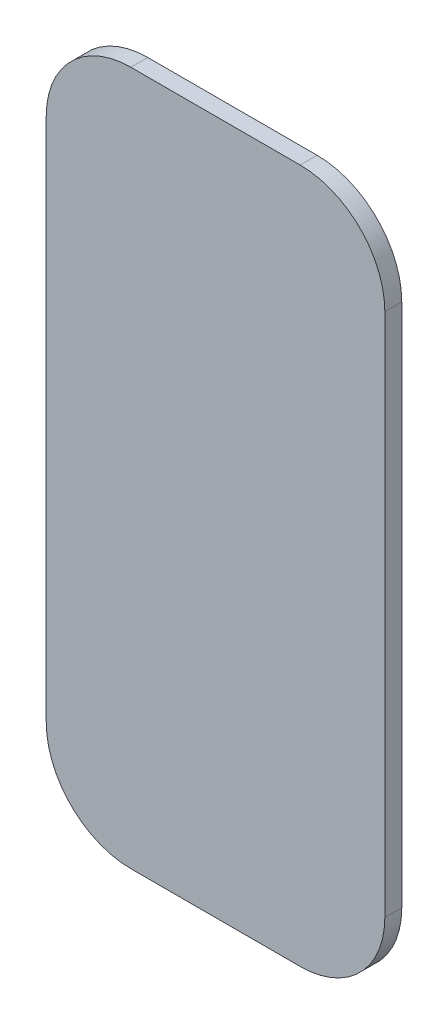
ISO-10303-21;
HEADER;
FILE_DESCRIPTION(('STEP AP214'),'2;1');
FILE_NAME('part.step','',(''),(''),'','','');
FILE_SCHEMA(('AUTOMOTIVE_DESIGN { 1 0 10303 214 1 1 1 1 }'));
ENDSEC;
DATA;
#1=APPLICATION_CONTEXT('core data for automotive mechanical design processes');
#2=APPLICATION_PROTOCOL_DEFINITION('international standard','automotive_design',2000,#1);
#3=PRODUCT_CONTEXT('',#1,'mechanical');
#4=PRODUCT('Part','Part','',(#3));
#5=PRODUCT_RELATED_PRODUCT_CATEGORY('part','',(#4));
#6=PRODUCT_DEFINITION_FORMATION('','',#4);
#7=PRODUCT_DEFINITION_CONTEXT('part definition',#1,'design');
#8=PRODUCT_DEFINITION('design','',#6,#7);
#9=PRODUCT_DEFINITION_SHAPE('','',#8);
#10=(LENGTH_UNIT() NAMED_UNIT(*) SI_UNIT(.MILLI.,.METRE.));
#11=(NAMED_UNIT(*) PLANE_ANGLE_UNIT() SI_UNIT($,.RADIAN.));
#12=(NAMED_UNIT(*) SI_UNIT($,.STERADIAN.) SOLID_ANGLE_UNIT());
#13=UNCERTAINTY_MEASURE_WITH_UNIT(LENGTH_MEASURE(1.E-05),#10,'distance_accuracy_value','');
#14=(GEOMETRIC_REPRESENTATION_CONTEXT(3) GLOBAL_UNCERTAINTY_ASSIGNED_CONTEXT((#13)) GLOBAL_UNIT_ASSIGNED_CONTEXT((#10,
#11,#12)) REPRESENTATION_CONTEXT('',''));
#15=CARTESIAN_POINT('',(0.,0.,0.));
#16=DIRECTION('',(0.,0.,1.));
#17=DIRECTION('',(1.,0.,0.));
#18=AXIS2_PLACEMENT_3D('',#15,#16,#17);
#19=CARTESIAN_POINT('',(250.,-775.,-50.));
#20=DIRECTION('',(0.,0.,1.));
#21=DIRECTION('',(1.,0.,0.));
#22=AXIS2_PLACEMENT_3D('',#19,#20,#21);
#23=CYLINDRICAL_SURFACE('',#22,250.);
#24=CARTESIAN_POINT('',(250.,-775.,0.));
#25=DIRECTION('',(0.,0.,1.));
#26=DIRECTION('',(1.,0.,0.));
#27=AXIS2_PLACEMENT_3D('',#24,#25,#26);
#28=CIRCLE('',#27,250.);
#29=CARTESIAN_POINT('',(249.999999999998,-1025.,0.));
#30=VERTEX_POINT('',#29);
#31=CARTESIAN_POINT('',(500.,-774.999999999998,0.));
#32=VERTEX_POINT('',#31);
#33=EDGE_CURVE('E134',#30,#32,#28,.T.);
#34=ORIENTED_EDGE('',*,*,#33,.F.);
#35=DIRECTION('',(0.,0.,1.));
#36=VECTOR('',#35,1.);
#37=CARTESIAN_POINT('',(249.999999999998,-1025.,-50.));
#38=LINE('',#37,#36);
#39=CARTESIAN_POINT('',(249.999999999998,-1025.,-50.));
#40=VERTEX_POINT('',#39);
#41=EDGE_CURVE('E11',#40,#30,#38,.T.);
#42=ORIENTED_EDGE('',*,*,#41,.F.);
#43=CARTESIAN_POINT('',(250.,-775.,-50.));
#44=DIRECTION('',(0.,0.,1.));
#45=DIRECTION('',(1.,0.,0.));
#46=AXIS2_PLACEMENT_3D('',#43,#44,#45);
#47=CIRCLE('',#46,250.);
#48=CARTESIAN_POINT('',(500.,-774.999999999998,-50.));
#49=VERTEX_POINT('',#48);
#50=EDGE_CURVE('E154',#40,#49,#47,.T.);
#51=ORIENTED_EDGE('',*,*,#50,.T.);
#52=DIRECTION('',(0.,0.,1.));
#53=VECTOR('',#52,1.);
#54=CARTESIAN_POINT('',(500.,-774.999999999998,-50.));
#55=LINE('',#54,#53);
#56=EDGE_CURVE('E40',#49,#32,#55,.T.);
#57=ORIENTED_EDGE('',*,*,#56,.T.);
#58=EDGE_LOOP('',(#34,#42,#51,#57));
#59=FACE_BOUND('',#58,.T.);
#60=ADVANCED_FACE('F37',(#59),#23,.T.);
#61=CARTESIAN_POINT('',(-249.999999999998,-1025.,-50.));
#62=DIRECTION('',(0.,-1.,0.));
#63=DIRECTION('',(0.,0.,-1.));
#64=AXIS2_PLACEMENT_3D('',#61,#62,#63);
#65=PLANE('',#64);
#66=DIRECTION('',(1.,0.,0.));
#67=VECTOR('',#66,1.);
#68=CARTESIAN_POINT('',(-249.999999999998,-1025.,0.));
#69=LINE('',#68,#67);
#70=CARTESIAN_POINT('',(-249.999999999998,-1025.,0.));
#71=VERTEX_POINT('',#70);
#72=EDGE_CURVE('E152',#71,#30,#69,.T.);
#73=ORIENTED_EDGE('',*,*,#72,.F.);
#74=DIRECTION('',(0.,0.,1.));
#75=VECTOR('',#74,1.);
#76=CARTESIAN_POINT('',(-249.999999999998,-1025.,-50.));
#77=LINE('',#76,#75);
#78=CARTESIAN_POINT('',(-249.999999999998,-1025.,-50.));
#79=VERTEX_POINT('',#78);
#80=EDGE_CURVE('E46',#79,#71,#77,.T.);
#81=ORIENTED_EDGE('',*,*,#80,.F.);
#82=DIRECTION('',(1.,0.,0.));
#83=VECTOR('',#82,1.);
#84=CARTESIAN_POINT('',(-249.999999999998,-1025.,-50.));
#85=LINE('',#84,#83);
#86=EDGE_CURVE('E124',#79,#40,#85,.T.);
#87=ORIENTED_EDGE('',*,*,#86,.T.);
#88=ORIENTED_EDGE('',*,*,#41,.T.);
#89=EDGE_LOOP('',(#73,#81,#87,#88));
#90=FACE_BOUND('',#89,.T.);
#91=ADVANCED_FACE('F166',(#90),#65,.T.);
#92=CARTESIAN_POINT('',(-250.,-775.,-50.));
#93=DIRECTION('',(0.,0.,1.));
#94=DIRECTION('',(1.,0.,0.));
#95=AXIS2_PLACEMENT_3D('',#92,#93,#94);
#96=CYLINDRICAL_SURFACE('',#95,250.);
#97=CARTESIAN_POINT('',(-250.,-775.,0.));
#98=DIRECTION('',(0.,0.,1.));
#99=DIRECTION('',(1.,0.,0.));
#100=AXIS2_PLACEMENT_3D('',#97,#98,#99);
#101=CIRCLE('',#100,250.);
#102=CARTESIAN_POINT('',(-500.,-774.999999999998,0.));
#103=VERTEX_POINT('',#102);
#104=EDGE_CURVE('E111',#103,#71,#101,.T.);
#105=ORIENTED_EDGE('',*,*,#104,.F.);
#106=DIRECTION('',(0.,0.,1.));
#107=VECTOR('',#106,1.);
#108=CARTESIAN_POINT('',(-500.,-774.999999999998,-50.));
#109=LINE('',#108,#107);
#110=CARTESIAN_POINT('',(-500.,-774.999999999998,-50.));
#111=VERTEX_POINT('',#110);
#112=EDGE_CURVE('E106',#111,#103,#109,.T.);
#113=ORIENTED_EDGE('',*,*,#112,.F.);
#114=CARTESIAN_POINT('',(-250.,-775.,-50.));
#115=DIRECTION('',(0.,0.,1.));
#116=DIRECTION('',(1.,0.,0.));
#117=AXIS2_PLACEMENT_3D('',#114,#115,#116);
#118=CIRCLE('',#117,250.);
#119=EDGE_CURVE('E109',#111,#79,#118,.T.);
#120=ORIENTED_EDGE('',*,*,#119,.T.);
#121=ORIENTED_EDGE('',*,*,#80,.T.);
#122=EDGE_LOOP('',(#105,#113,#120,#121));
#123=FACE_BOUND('',#122,.T.);
#124=ADVANCED_FACE('F108',(#123),#96,.T.);
#125=CARTESIAN_POINT('',(-500.,774.999999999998,-50.));
#126=DIRECTION('',(-1.,0.,0.));
#127=DIRECTION('',(0.,-1.,0.));
#128=AXIS2_PLACEMENT_3D('',#125,#126,#127);
#129=PLANE('',#128);
#130=DIRECTION('',(0.,-1.,0.));
#131=VECTOR('',#130,1.);
#132=CARTESIAN_POINT('',(-500.,774.999999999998,0.));
#133=LINE('',#132,#131);
#134=CARTESIAN_POINT('',(-500.,774.999999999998,0.));
#135=VERTEX_POINT('',#134);
#136=EDGE_CURVE('E149',#135,#103,#133,.T.);
#137=ORIENTED_EDGE('',*,*,#136,.F.);
#138=DIRECTION('',(0.,0.,1.));
#139=VECTOR('',#138,1.);
#140=CARTESIAN_POINT('',(-500.,774.999999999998,-50.));
#141=LINE('',#140,#139);
#142=CARTESIAN_POINT('',(-500.,774.999999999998,-50.));
#143=VERTEX_POINT('',#142);
#144=EDGE_CURVE('E116',#143,#135,#141,.T.);
#145=ORIENTED_EDGE('',*,*,#144,.F.);
#146=DIRECTION('',(0.,-1.,0.));
#147=VECTOR('',#146,1.);
#148=CARTESIAN_POINT('',(-500.,774.999999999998,-50.));
#149=LINE('',#148,#147);
#150=EDGE_CURVE('E122',#143,#111,#149,.T.);
#151=ORIENTED_EDGE('',*,*,#150,.T.);
#152=ORIENTED_EDGE('',*,*,#112,.T.);
#153=EDGE_LOOP('',(#137,#145,#151,#152));
#154=FACE_BOUND('',#153,.T.);
#155=ADVANCED_FACE('F126',(#154),#129,.T.);
#156=CARTESIAN_POINT('',(-250.,775.,-50.));
#157=DIRECTION('',(0.,0.,1.));
#158=DIRECTION('',(1.,0.,0.));
#159=AXIS2_PLACEMENT_3D('',#156,#157,#158);
#160=CYLINDRICAL_SURFACE('',#159,250.);
#161=CARTESIAN_POINT('',(-250.,775.,0.));
#162=DIRECTION('',(0.,0.,1.));
#163=DIRECTION('',(1.,0.,0.));
#164=AXIS2_PLACEMENT_3D('',#161,#162,#163);
#165=CIRCLE('',#164,250.);
#166=CARTESIAN_POINT('',(-249.999999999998,1025.,0.));
#167=VERTEX_POINT('',#166);
#168=EDGE_CURVE('E146',#167,#135,#165,.T.);
#169=ORIENTED_EDGE('',*,*,#168,.F.);
#170=DIRECTION('',(0.,0.,1.));
#171=VECTOR('',#170,1.);
#172=CARTESIAN_POINT('',(-249.999999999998,1025.,-50.));
#173=LINE('',#172,#171);
#174=CARTESIAN_POINT('',(-249.999999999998,1025.,-50.));
#175=VERTEX_POINT('',#174);
#176=EDGE_CURVE('E158',#175,#167,#173,.T.);
#177=ORIENTED_EDGE('',*,*,#176,.F.);
#178=CARTESIAN_POINT('',(-250.,775.,-50.));
#179=DIRECTION('',(0.,0.,1.));
#180=DIRECTION('',(1.,0.,0.));
#181=AXIS2_PLACEMENT_3D('',#178,#179,#180);
#182=CIRCLE('',#181,250.);
#183=EDGE_CURVE('E127',#175,#143,#182,.T.);
#184=ORIENTED_EDGE('',*,*,#183,.T.);
#185=ORIENTED_EDGE('',*,*,#144,.T.);
#186=EDGE_LOOP('',(#169,#177,#184,#185));
#187=FACE_BOUND('',#186,.T.);
#188=ADVANCED_FACE('F179',(#187),#160,.T.);
#189=CARTESIAN_POINT('',(-249.999999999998,1025.,-50.));
#190=DIRECTION('',(0.,1.,0.));
#191=DIRECTION('',(0.,0.,1.));
#192=AXIS2_PLACEMENT_3D('',#189,#190,#191);
#193=PLANE('',#192);
#194=DIRECTION('',(-1.,0.,0.));
#195=VECTOR('',#194,1.);
#196=CARTESIAN_POINT('',(-249.999999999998,1025.,0.));
#197=LINE('',#196,#195);
#198=CARTESIAN_POINT('',(249.999999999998,1025.,0.));
#199=VERTEX_POINT('',#198);
#200=EDGE_CURVE('E143',#199,#167,#197,.T.);
#201=ORIENTED_EDGE('',*,*,#200,.F.);
#202=DIRECTION('',(0.,0.,1.));
#203=VECTOR('',#202,1.);
#204=CARTESIAN_POINT('',(249.999999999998,1025.,-50.));
#205=LINE('',#204,#203);
#206=CARTESIAN_POINT('',(249.999999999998,1025.,-50.));
#207=VERTEX_POINT('',#206);
#208=EDGE_CURVE('E160',#207,#199,#205,.T.);
#209=ORIENTED_EDGE('',*,*,#208,.F.);
#210=DIRECTION('',(-1.,0.,0.));
#211=VECTOR('',#210,1.);
#212=CARTESIAN_POINT('',(-249.999999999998,1025.,-50.));
#213=LINE('',#212,#211);
#214=EDGE_CURVE('E129',#207,#175,#213,.T.);
#215=ORIENTED_EDGE('',*,*,#214,.T.);
#216=ORIENTED_EDGE('',*,*,#176,.T.);
#217=EDGE_LOOP('',(#201,#209,#215,#216));
#218=FACE_BOUND('',#217,.T.);
#219=ADVANCED_FACE('F182',(#218),#193,.T.);
#220=CARTESIAN_POINT('',(250.,775.,-50.));
#221=DIRECTION('',(0.,0.,1.));
#222=DIRECTION('',(1.,0.,0.));
#223=AXIS2_PLACEMENT_3D('',#220,#221,#222);
#224=CYLINDRICAL_SURFACE('',#223,250.);
#225=CARTESIAN_POINT('',(250.,775.,0.));
#226=DIRECTION('',(0.,0.,1.));
#227=DIRECTION('',(-1.,0.,0.));
#228=AXIS2_PLACEMENT_3D('',#225,#226,#227);
#229=CIRCLE('',#228,250.);
#230=CARTESIAN_POINT('',(500.,774.999999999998,0.));
#231=VERTEX_POINT('',#230);
#232=EDGE_CURVE('E140',#231,#199,#229,.T.);
#233=ORIENTED_EDGE('',*,*,#232,.F.);
#234=DIRECTION('',(0.,0.,1.));
#235=VECTOR('',#234,1.);
#236=CARTESIAN_POINT('',(500.,774.999999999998,-50.));
#237=LINE('',#236,#235);
#238=CARTESIAN_POINT('',(500.,774.999999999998,-50.));
#239=VERTEX_POINT('',#238);
#240=EDGE_CURVE('E161',#239,#231,#237,.T.);
#241=ORIENTED_EDGE('',*,*,#240,.F.);
#242=CARTESIAN_POINT('',(250.,775.,-50.));
#243=DIRECTION('',(0.,0.,1.));
#244=DIRECTION('',(-1.,0.,0.));
#245=AXIS2_PLACEMENT_3D('',#242,#243,#244);
#246=CIRCLE('',#245,250.);
#247=EDGE_CURVE('E257',#239,#207,#246,.T.);
#248=ORIENTED_EDGE('',*,*,#247,.T.);
#249=ORIENTED_EDGE('',*,*,#208,.T.);
#250=EDGE_LOOP('',(#233,#241,#248,#249));
#251=FACE_BOUND('',#250,.T.);
#252=ADVANCED_FACE('F186',(#251),#224,.T.);
#253=CARTESIAN_POINT('',(500.,774.999999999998,-50.));
#254=DIRECTION('',(1.,0.,0.));
#255=DIRECTION('',(0.,1.,0.));
#256=AXIS2_PLACEMENT_3D('',#253,#254,#255);
#257=PLANE('',#256);
#258=DIRECTION('',(0.,1.,0.));
#259=VECTOR('',#258,1.);
#260=CARTESIAN_POINT('',(500.,774.999999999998,0.));
#261=LINE('',#260,#259);
#262=EDGE_CURVE('E137',#32,#231,#261,.T.);
#263=ORIENTED_EDGE('',*,*,#262,.F.);
#264=ORIENTED_EDGE('',*,*,#56,.F.);
#265=DIRECTION('',(0.,1.,0.));
#266=VECTOR('',#265,1.);
#267=CARTESIAN_POINT('',(500.,774.999999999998,-50.));
#268=LINE('',#267,#266);
#269=EDGE_CURVE('E258',#49,#239,#268,.T.);
#270=ORIENTED_EDGE('',*,*,#269,.T.);
#271=ORIENTED_EDGE('',*,*,#240,.T.);
#272=EDGE_LOOP('',(#263,#264,#270,#271));
#273=FACE_BOUND('',#272,.T.);
#274=ADVANCED_FACE('F163',(#273),#257,.T.);
#275=CARTESIAN_POINT('',(250.,-775.,-50.));
#276=DIRECTION('',(0.,0.,1.));
#277=DIRECTION('',(1.,0.,0.));
#278=AXIS2_PLACEMENT_3D('',#275,#276,#277);
#279=PLANE('',#278);
#280=ORIENTED_EDGE('',*,*,#50,.F.);
#281=ORIENTED_EDGE('',*,*,#86,.F.);
#282=ORIENTED_EDGE('',*,*,#119,.F.);
#283=ORIENTED_EDGE('',*,*,#150,.F.);
#284=ORIENTED_EDGE('',*,*,#183,.F.);
#285=ORIENTED_EDGE('',*,*,#214,.F.);
#286=ORIENTED_EDGE('',*,*,#247,.F.);
#287=ORIENTED_EDGE('',*,*,#269,.F.);
#288=EDGE_LOOP('',(#280,#281,#282,#283,#284,#285,#286,#287));
#289=FACE_BOUND('',#288,.T.);
#290=ADVANCED_FACE('F120',(#289),#279,.F.);
#291=CARTESIAN_POINT('',(250.,-775.,0.));
#292=DIRECTION('',(0.,0.,1.));
#293=DIRECTION('',(1.,0.,0.));
#294=AXIS2_PLACEMENT_3D('',#291,#292,#293);
#295=PLANE('',#294);
#296=ORIENTED_EDGE('',*,*,#33,.T.);
#297=ORIENTED_EDGE('',*,*,#262,.T.);
#298=ORIENTED_EDGE('',*,*,#232,.T.);
#299=ORIENTED_EDGE('',*,*,#200,.T.);
#300=ORIENTED_EDGE('',*,*,#168,.T.);
#301=ORIENTED_EDGE('',*,*,#136,.T.);
#302=ORIENTED_EDGE('',*,*,#104,.T.);
#303=ORIENTED_EDGE('',*,*,#72,.T.);
#304=EDGE_LOOP('',(#296,#297,#298,#299,#300,#301,#302,#303));
#305=FACE_BOUND('',#304,.T.);
#306=ADVANCED_FACE('F165',(#305),#295,.T.);
#307=CLOSED_SHELL('',(#60,#91,#124,#155,#188,#219,#252,#274,#290,#306));
#308=MANIFOLD_SOLID_BREP('B2',#307);
#309=ADVANCED_BREP_SHAPE_REPRESENTATION('',(#18,#308),#14);
#310=SHAPE_DEFINITION_REPRESENTATION(#9,#309);
ENDSEC;
END-ISO-10303-21;
